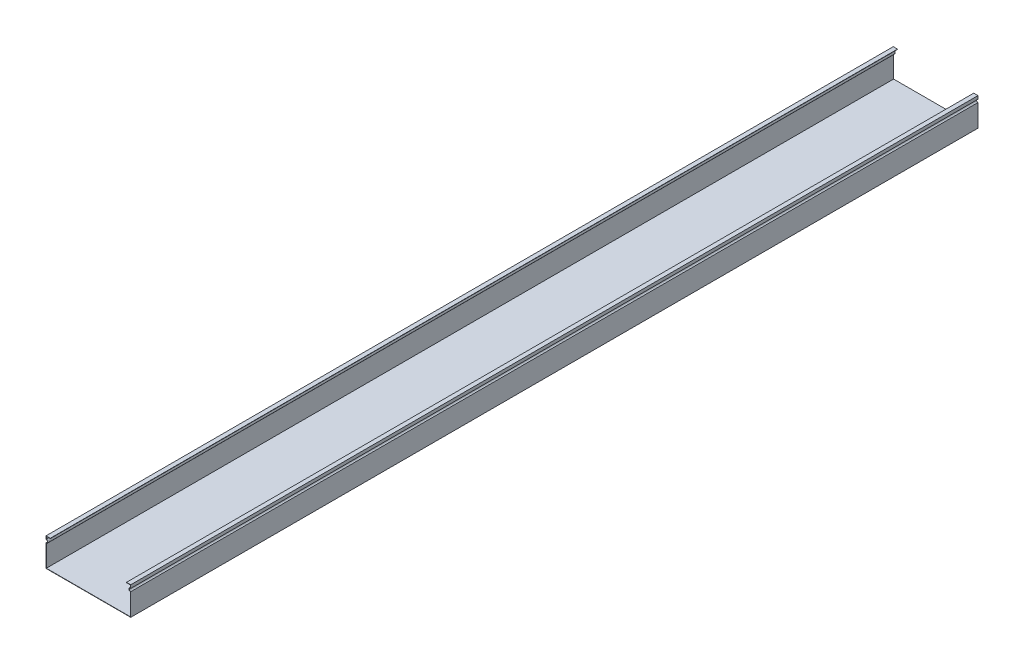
ISO-10303-21;
HEADER;
FILE_DESCRIPTION(('STEP AP214'),'2;1');
FILE_NAME('part.step','',(''),(''),'','','');
FILE_SCHEMA(('AUTOMOTIVE_DESIGN { 1 0 10303 214 1 1 1 1 }'));
ENDSEC;
DATA;
#1=APPLICATION_CONTEXT('core data for automotive mechanical design processes');
#2=APPLICATION_PROTOCOL_DEFINITION('international standard','automotive_design',2000,#1);
#3=PRODUCT_CONTEXT('',#1,'mechanical');
#4=PRODUCT('Part','Part','',(#3));
#5=PRODUCT_RELATED_PRODUCT_CATEGORY('part','',(#4));
#6=PRODUCT_DEFINITION_FORMATION('','',#4);
#7=PRODUCT_DEFINITION_CONTEXT('part definition',#1,'design');
#8=PRODUCT_DEFINITION('design','',#6,#7);
#9=PRODUCT_DEFINITION_SHAPE('','',#8);
#10=(LENGTH_UNIT() NAMED_UNIT(*) SI_UNIT(.MILLI.,.METRE.));
#11=(NAMED_UNIT(*) PLANE_ANGLE_UNIT() SI_UNIT($,.RADIAN.));
#12=(NAMED_UNIT(*) SI_UNIT($,.STERADIAN.) SOLID_ANGLE_UNIT());
#13=UNCERTAINTY_MEASURE_WITH_UNIT(LENGTH_MEASURE(1.E-05),#10,'distance_accuracy_value','');
#14=(GEOMETRIC_REPRESENTATION_CONTEXT(3) GLOBAL_UNCERTAINTY_ASSIGNED_CONTEXT((#13)) GLOBAL_UNIT_ASSIGNED_CONTEXT((#10,
#11,#12)) REPRESENTATION_CONTEXT('',''));
#15=CARTESIAN_POINT('',(0.,0.,0.));
#16=DIRECTION('',(0.,0.,1.));
#17=DIRECTION('',(1.,0.,0.));
#18=AXIS2_PLACEMENT_3D('',#15,#16,#17);
#19=CARTESIAN_POINT('',(0.,0.,3000.));
#20=DIRECTION('',(-1.,0.,0.));
#21=DIRECTION('',(0.,0.,1.));
#22=AXIS2_PLACEMENT_3D('',#19,#20,#21);
#23=PLANE('',#22);
#24=DIRECTION('',(0.,1.,0.));
#25=VECTOR('',#24,1.);
#26=CARTESIAN_POINT('',(0.,0.,0.));
#27=LINE('',#26,#25);
#28=CARTESIAN_POINT('',(0.,-1.21412,0.));
#29=VERTEX_POINT('',#28);
#30=CARTESIAN_POINT('',(0.,0.,0.));
#31=VERTEX_POINT('',#30);
#32=EDGE_CURVE('E199',#29,#31,#27,.T.);
#33=ORIENTED_EDGE('',*,*,#32,.T.);
#34=DIRECTION('',(0.,0.,-1.));
#35=VECTOR('',#34,1.);
#36=CARTESIAN_POINT('',(0.,0.,3000.));
#37=LINE('',#36,#35);
#38=CARTESIAN_POINT('',(0.,0.,3000.));
#39=VERTEX_POINT('',#38);
#40=EDGE_CURVE('E11',#39,#31,#37,.T.);
#41=ORIENTED_EDGE('',*,*,#40,.F.);
#42=DIRECTION('',(0.,1.,0.));
#43=VECTOR('',#42,1.);
#44=CARTESIAN_POINT('',(0.,0.,3000.));
#45=LINE('',#44,#43);
#46=CARTESIAN_POINT('',(0.,-1.21412,3000.));
#47=VERTEX_POINT('',#46);
#48=EDGE_CURVE('E237',#47,#39,#45,.T.);
#49=ORIENTED_EDGE('',*,*,#48,.F.);
#50=DIRECTION('',(0.,0.,-1.));
#51=VECTOR('',#50,1.);
#52=CARTESIAN_POINT('',(0.,-1.21412,3000.));
#53=LINE('',#52,#51);
#54=EDGE_CURVE('E195',#47,#29,#53,.T.);
#55=ORIENTED_EDGE('',*,*,#54,.T.);
#56=EDGE_LOOP('',(#33,#41,#49,#55));
#57=FACE_BOUND('',#56,.T.);
#58=ADVANCED_FACE('F31',(#57),#23,.F.);
#59=CARTESIAN_POINT('',(0.,0.,3000.));
#60=DIRECTION('',(0.,-1.,0.));
#61=DIRECTION('',(1.,0.,0.));
#62=AXIS2_PLACEMENT_3D('',#59,#60,#61);
#63=PLANE('',#62);
#64=DIRECTION('',(-1.,0.,0.));
#65=VECTOR('',#64,1.);
#66=CARTESIAN_POINT('',(0.,0.,0.));
#67=LINE('',#66,#65);
#68=CARTESIAN_POINT('',(-15.,0.,0.));
#69=VERTEX_POINT('',#68);
#70=EDGE_CURVE('E202',#31,#69,#67,.T.);
#71=ORIENTED_EDGE('',*,*,#70,.T.);
#72=DIRECTION('',(0.,0.,-1.));
#73=VECTOR('',#72,1.);
#74=CARTESIAN_POINT('',(-15.,0.,3000.));
#75=LINE('',#74,#73);
#76=CARTESIAN_POINT('',(-15.,0.,3000.));
#77=VERTEX_POINT('',#76);
#78=EDGE_CURVE('E39',#77,#69,#75,.T.);
#79=ORIENTED_EDGE('',*,*,#78,.F.);
#80=DIRECTION('',(-1.,0.,0.));
#81=VECTOR('',#80,1.);
#82=CARTESIAN_POINT('',(0.,0.,3000.));
#83=LINE('',#82,#81);
#84=EDGE_CURVE('E126',#39,#77,#83,.T.);
#85=ORIENTED_EDGE('',*,*,#84,.F.);
#86=ORIENTED_EDGE('',*,*,#40,.T.);
#87=EDGE_LOOP('',(#71,#79,#85,#86));
#88=FACE_BOUND('',#87,.T.);
#89=ADVANCED_FACE('F355',(#88),#63,.F.);
#90=CARTESIAN_POINT('',(-15.,0.,3000.));
#91=DIRECTION('',(1.,0.,0.));
#92=DIRECTION('',(0.,1.,0.));
#93=AXIS2_PLACEMENT_3D('',#90,#91,#92);
#94=PLANE('',#93);
#95=DIRECTION('',(0.,-1.,0.));
#96=VECTOR('',#95,1.);
#97=CARTESIAN_POINT('',(-15.,0.,0.));
#98=LINE('',#97,#96);
#99=CARTESIAN_POINT('',(-15.,-11.21412,0.));
#100=VERTEX_POINT('',#99);
#101=EDGE_CURVE('E204',#69,#100,#98,.T.);
#102=ORIENTED_EDGE('',*,*,#101,.T.);
#103=DIRECTION('',(0.,0.,-1.));
#104=VECTOR('',#103,1.);
#105=CARTESIAN_POINT('',(-15.,-11.21412,3000.));
#106=LINE('',#105,#104);
#107=CARTESIAN_POINT('',(-15.,-11.21412,3000.));
#108=VERTEX_POINT('',#107);
#109=EDGE_CURVE('E280',#108,#100,#106,.T.);
#110=ORIENTED_EDGE('',*,*,#109,.F.);
#111=DIRECTION('',(0.,-1.,0.));
#112=VECTOR('',#111,1.);
#113=CARTESIAN_POINT('',(-15.,0.,3000.));
#114=LINE('',#113,#112);
#115=EDGE_CURVE('E288',#77,#108,#114,.T.);
#116=ORIENTED_EDGE('',*,*,#115,.F.);
#117=ORIENTED_EDGE('',*,*,#78,.T.);
#118=EDGE_LOOP('',(#102,#110,#116,#117));
#119=FACE_BOUND('',#118,.T.);
#120=ADVANCED_FACE('F286',(#119),#94,.F.);
#121=CARTESIAN_POINT('',(-15.,-16.21412,3000.));
#122=DIRECTION('',(0.,0.,-1.));
#123=DIRECTION('',(-1.,0.,0.));
#124=AXIS2_PLACEMENT_3D('',#121,#122,#123);
#125=CYLINDRICAL_SURFACE('',#124,5.);
#126=CARTESIAN_POINT('',(-15.,-16.21412,0.));
#127=DIRECTION('',(0.,0.,-1.));
#128=DIRECTION('',(-1.,0.,0.));
#129=AXIS2_PLACEMENT_3D('',#126,#127,#128);
#130=CIRCLE('',#129,5.);
#131=CARTESIAN_POINT('',(-15.,-21.21412,0.));
#132=VERTEX_POINT('',#131);
#133=EDGE_CURVE('E206',#100,#132,#130,.T.);
#134=ORIENTED_EDGE('',*,*,#133,.T.);
#135=DIRECTION('',(0.,0.,-1.));
#136=VECTOR('',#135,1.);
#137=CARTESIAN_POINT('',(-15.,-21.21412,3000.));
#138=LINE('',#137,#136);
#139=CARTESIAN_POINT('',(-15.,-21.21412,3000.));
#140=VERTEX_POINT('',#139);
#141=EDGE_CURVE('E277',#140,#132,#138,.T.);
#142=ORIENTED_EDGE('',*,*,#141,.F.);
#143=CARTESIAN_POINT('',(-15.,-16.21412,3000.));
#144=DIRECTION('',(0.,0.,-1.));
#145=DIRECTION('',(-1.,0.,0.));
#146=AXIS2_PLACEMENT_3D('',#143,#144,#145);
#147=CIRCLE('',#146,5.);
#148=EDGE_CURVE('E306',#108,#140,#147,.T.);
#149=ORIENTED_EDGE('',*,*,#148,.F.);
#150=ORIENTED_EDGE('',*,*,#109,.T.);
#151=EDGE_LOOP('',(#134,#142,#149,#150));
#152=FACE_BOUND('',#151,.T.);
#153=ADVANCED_FACE('F297',(#152),#125,.F.);
#154=CARTESIAN_POINT('',(-15.,-21.21412,3000.));
#155=DIRECTION('',(1.,0.,0.));
#156=DIRECTION('',(0.,1.,0.));
#157=AXIS2_PLACEMENT_3D('',#154,#155,#156);
#158=PLANE('',#157);
#159=DIRECTION('',(0.,-1.,0.));
#160=VECTOR('',#159,1.);
#161=CARTESIAN_POINT('',(-15.,-21.21412,0.));
#162=LINE('',#161,#160);
#163=CARTESIAN_POINT('',(-15.,-100.,0.));
#164=VERTEX_POINT('',#163);
#165=EDGE_CURVE('E208',#132,#164,#162,.T.);
#166=ORIENTED_EDGE('',*,*,#165,.T.);
#167=DIRECTION('',(0.,0.,-1.));
#168=VECTOR('',#167,1.);
#169=CARTESIAN_POINT('',(-15.,-100.,3000.));
#170=LINE('',#169,#168);
#171=CARTESIAN_POINT('',(-15.,-100.,3000.));
#172=VERTEX_POINT('',#171);
#173=EDGE_CURVE('E274',#172,#164,#170,.T.);
#174=ORIENTED_EDGE('',*,*,#173,.F.);
#175=DIRECTION('',(0.,-1.,0.));
#176=VECTOR('',#175,1.);
#177=CARTESIAN_POINT('',(-15.,-21.21412,3000.));
#178=LINE('',#177,#176);
#179=EDGE_CURVE('E303',#140,#172,#178,.T.);
#180=ORIENTED_EDGE('',*,*,#179,.F.);
#181=ORIENTED_EDGE('',*,*,#141,.T.);
#182=EDGE_LOOP('',(#166,#174,#180,#181));
#183=FACE_BOUND('',#182,.T.);
#184=ADVANCED_FACE('F301',(#183),#158,.F.);
#185=CARTESIAN_POINT('',(-15.,-100.,3000.));
#186=DIRECTION('',(0.,1.,0.));
#187=DIRECTION('',(0.,0.,1.));
#188=AXIS2_PLACEMENT_3D('',#185,#186,#187);
#189=PLANE('',#188);
#190=DIRECTION('',(1.,0.,0.));
#191=VECTOR('',#190,1.);
#192=CARTESIAN_POINT('',(-15.,-100.,0.));
#193=LINE('',#192,#191);
#194=CARTESIAN_POINT('',(285.,-100.,0.));
#195=VERTEX_POINT('',#194);
#196=EDGE_CURVE('E210',#164,#195,#193,.T.);
#197=ORIENTED_EDGE('',*,*,#196,.T.);
#198=DIRECTION('',(0.,0.,-1.));
#199=VECTOR('',#198,1.);
#200=CARTESIAN_POINT('',(285.,-100.,3000.));
#201=LINE('',#200,#199);
#202=CARTESIAN_POINT('',(285.,-100.,3000.));
#203=VERTEX_POINT('',#202);
#204=EDGE_CURVE('E271',#203,#195,#201,.T.);
#205=ORIENTED_EDGE('',*,*,#204,.F.);
#206=DIRECTION('',(1.,0.,0.));
#207=VECTOR('',#206,1.);
#208=CARTESIAN_POINT('',(-15.,-100.,3000.));
#209=LINE('',#208,#207);
#210=EDGE_CURVE('E305',#172,#203,#209,.T.);
#211=ORIENTED_EDGE('',*,*,#210,.F.);
#212=ORIENTED_EDGE('',*,*,#173,.T.);
#213=EDGE_LOOP('',(#197,#205,#211,#212));
#214=FACE_BOUND('',#213,.T.);
#215=ADVANCED_FACE('F368',(#214),#189,.F.);
#216=CARTESIAN_POINT('',(285.,-100.,3000.));
#217=DIRECTION('',(-1.,0.,0.));
#218=DIRECTION('',(0.,-1.,0.));
#219=AXIS2_PLACEMENT_3D('',#216,#217,#218);
#220=PLANE('',#219);
#221=DIRECTION('',(0.,1.,0.));
#222=VECTOR('',#221,1.);
#223=CARTESIAN_POINT('',(285.,-100.,0.));
#224=LINE('',#223,#222);
#225=CARTESIAN_POINT('',(285.,-21.21412,0.));
#226=VERTEX_POINT('',#225);
#227=EDGE_CURVE('E212',#195,#226,#224,.T.);
#228=ORIENTED_EDGE('',*,*,#227,.T.);
#229=DIRECTION('',(0.,0.,-1.));
#230=VECTOR('',#229,1.);
#231=CARTESIAN_POINT('',(285.,-21.21412,3000.));
#232=LINE('',#231,#230);
#233=CARTESIAN_POINT('',(285.,-21.21412,3000.));
#234=VERTEX_POINT('',#233);
#235=EDGE_CURVE('E268',#234,#226,#232,.T.);
#236=ORIENTED_EDGE('',*,*,#235,.F.);
#237=DIRECTION('',(0.,1.,0.));
#238=VECTOR('',#237,1.);
#239=CARTESIAN_POINT('',(285.,-100.,3000.));
#240=LINE('',#239,#238);
#241=EDGE_CURVE('E308',#203,#234,#240,.T.);
#242=ORIENTED_EDGE('',*,*,#241,.F.);
#243=ORIENTED_EDGE('',*,*,#204,.T.);
#244=EDGE_LOOP('',(#228,#236,#242,#243));
#245=FACE_BOUND('',#244,.T.);
#246=ADVANCED_FACE('F371',(#245),#220,.F.);
#247=CARTESIAN_POINT('',(285.,-16.21412,3000.));
#248=DIRECTION('',(0.,0.,-1.));
#249=DIRECTION('',(-1.,0.,0.));
#250=AXIS2_PLACEMENT_3D('',#247,#248,#249);
#251=CYLINDRICAL_SURFACE('',#250,5.);
#252=CARTESIAN_POINT('',(285.,-16.21412,0.));
#253=DIRECTION('',(0.,0.,-1.));
#254=DIRECTION('',(1.,0.,0.));
#255=AXIS2_PLACEMENT_3D('',#252,#253,#254);
#256=CIRCLE('',#255,5.);
#257=CARTESIAN_POINT('',(285.,-11.21412,0.));
#258=VERTEX_POINT('',#257);
#259=EDGE_CURVE('E214',#226,#258,#256,.T.);
#260=ORIENTED_EDGE('',*,*,#259,.T.);
#261=DIRECTION('',(0.,0.,-1.));
#262=VECTOR('',#261,1.);
#263=CARTESIAN_POINT('',(285.,-11.21412,3000.));
#264=LINE('',#263,#262);
#265=CARTESIAN_POINT('',(285.,-11.21412,3000.));
#266=VERTEX_POINT('',#265);
#267=EDGE_CURVE('E265',#266,#258,#264,.T.);
#268=ORIENTED_EDGE('',*,*,#267,.F.);
#269=CARTESIAN_POINT('',(285.,-16.21412,3000.));
#270=DIRECTION('',(0.,0.,-1.));
#271=DIRECTION('',(1.,0.,0.));
#272=AXIS2_PLACEMENT_3D('',#269,#270,#271);
#273=CIRCLE('',#272,5.);
#274=EDGE_CURVE('E314',#234,#266,#273,.T.);
#275=ORIENTED_EDGE('',*,*,#274,.F.);
#276=ORIENTED_EDGE('',*,*,#235,.T.);
#277=EDGE_LOOP('',(#260,#268,#275,#276));
#278=FACE_BOUND('',#277,.T.);
#279=ADVANCED_FACE('F375',(#278),#251,.F.);
#280=CARTESIAN_POINT('',(285.,-11.21412,3000.));
#281=DIRECTION('',(-1.,0.,0.));
#282=DIRECTION('',(0.,-1.,0.));
#283=AXIS2_PLACEMENT_3D('',#280,#281,#282);
#284=PLANE('',#283);
#285=DIRECTION('',(0.,1.,0.));
#286=VECTOR('',#285,1.);
#287=CARTESIAN_POINT('',(285.,-11.21412,0.));
#288=LINE('',#287,#286);
#289=CARTESIAN_POINT('',(285.,0.,0.));
#290=VERTEX_POINT('',#289);
#291=EDGE_CURVE('E216',#258,#290,#288,.T.);
#292=ORIENTED_EDGE('',*,*,#291,.T.);
#293=DIRECTION('',(0.,0.,-1.));
#294=VECTOR('',#293,1.);
#295=CARTESIAN_POINT('',(285.,0.,3000.));
#296=LINE('',#295,#294);
#297=CARTESIAN_POINT('',(285.,0.,3000.));
#298=VERTEX_POINT('',#297);
#299=EDGE_CURVE('E262',#298,#290,#296,.T.);
#300=ORIENTED_EDGE('',*,*,#299,.F.);
#301=DIRECTION('',(0.,1.,0.));
#302=VECTOR('',#301,1.);
#303=CARTESIAN_POINT('',(285.,-11.21412,3000.));
#304=LINE('',#303,#302);
#305=EDGE_CURVE('E316',#266,#298,#304,.T.);
#306=ORIENTED_EDGE('',*,*,#305,.F.);
#307=ORIENTED_EDGE('',*,*,#267,.T.);
#308=EDGE_LOOP('',(#292,#300,#306,#307));
#309=FACE_BOUND('',#308,.T.);
#310=ADVANCED_FACE('F379',(#309),#284,.F.);
#311=CARTESIAN_POINT('',(285.,0.,3000.));
#312=DIRECTION('',(0.,-1.,0.));
#313=DIRECTION('',(1.,0.,0.));
#314=AXIS2_PLACEMENT_3D('',#311,#312,#313);
#315=PLANE('',#314);
#316=DIRECTION('',(-1.,0.,0.));
#317=VECTOR('',#316,1.);
#318=CARTESIAN_POINT('',(285.,0.,0.));
#319=LINE('',#318,#317);
#320=CARTESIAN_POINT('',(270.,0.,0.));
#321=VERTEX_POINT('',#320);
#322=EDGE_CURVE('E218',#290,#321,#319,.T.);
#323=ORIENTED_EDGE('',*,*,#322,.T.);
#324=DIRECTION('',(0.,0.,-1.));
#325=VECTOR('',#324,1.);
#326=CARTESIAN_POINT('',(270.,0.,3000.));
#327=LINE('',#326,#325);
#328=CARTESIAN_POINT('',(270.,0.,3000.));
#329=VERTEX_POINT('',#328);
#330=EDGE_CURVE('E259',#329,#321,#327,.T.);
#331=ORIENTED_EDGE('',*,*,#330,.F.);
#332=DIRECTION('',(-1.,0.,0.));
#333=VECTOR('',#332,1.);
#334=CARTESIAN_POINT('',(285.,0.,3000.));
#335=LINE('',#334,#333);
#336=EDGE_CURVE('E318',#298,#329,#335,.T.);
#337=ORIENTED_EDGE('',*,*,#336,.F.);
#338=ORIENTED_EDGE('',*,*,#299,.T.);
#339=EDGE_LOOP('',(#323,#331,#337,#338));
#340=FACE_BOUND('',#339,.T.);
#341=ADVANCED_FACE('F383',(#340),#315,.F.);
#342=CARTESIAN_POINT('',(270.,0.,3000.));
#343=DIRECTION('',(1.,0.,0.));
#344=DIRECTION('',(0.,0.,-1.));
#345=AXIS2_PLACEMENT_3D('',#342,#343,#344);
#346=PLANE('',#345);
#347=DIRECTION('',(0.,-1.,0.));
#348=VECTOR('',#347,1.);
#349=CARTESIAN_POINT('',(270.,0.,0.));
#350=LINE('',#349,#348);
#351=CARTESIAN_POINT('',(270.,-1.21412,0.));
#352=VERTEX_POINT('',#351);
#353=EDGE_CURVE('E220',#321,#352,#350,.T.);
#354=ORIENTED_EDGE('',*,*,#353,.T.);
#355=DIRECTION('',(0.,0.,-1.));
#356=VECTOR('',#355,1.);
#357=CARTESIAN_POINT('',(270.,-1.21412,3000.));
#358=LINE('',#357,#356);
#359=CARTESIAN_POINT('',(270.,-1.21412,3000.));
#360=VERTEX_POINT('',#359);
#361=EDGE_CURVE('E256',#360,#352,#358,.T.);
#362=ORIENTED_EDGE('',*,*,#361,.F.);
#363=DIRECTION('',(0.,-1.,0.));
#364=VECTOR('',#363,1.);
#365=CARTESIAN_POINT('',(270.,0.,3000.));
#366=LINE('',#365,#364);
#367=EDGE_CURVE('E320',#329,#360,#366,.T.);
#368=ORIENTED_EDGE('',*,*,#367,.F.);
#369=ORIENTED_EDGE('',*,*,#330,.T.);
#370=EDGE_LOOP('',(#354,#362,#368,#369));
#371=FACE_BOUND('',#370,.T.);
#372=ADVANCED_FACE('F387',(#371),#346,.F.);
#373=CARTESIAN_POINT('',(283.78588,-1.21412,3000.));
#374=DIRECTION('',(0.,1.,0.));
#375=DIRECTION('',(-1.,0.,0.));
#376=AXIS2_PLACEMENT_3D('',#373,#374,#375);
#377=PLANE('',#376);
#378=DIRECTION('',(1.,0.,0.));
#379=VECTOR('',#378,1.);
#380=CARTESIAN_POINT('',(283.78588,-1.21412,0.));
#381=LINE('',#380,#379);
#382=CARTESIAN_POINT('',(283.78588,-1.21412,0.));
#383=VERTEX_POINT('',#382);
#384=EDGE_CURVE('E222',#352,#383,#381,.T.);
#385=ORIENTED_EDGE('',*,*,#384,.T.);
#386=DIRECTION('',(0.,0.,-1.));
#387=VECTOR('',#386,1.);
#388=CARTESIAN_POINT('',(283.78588,-1.21412,3000.));
#389=LINE('',#388,#387);
#390=CARTESIAN_POINT('',(283.78588,-1.21412,3000.));
#391=VERTEX_POINT('',#390);
#392=EDGE_CURVE('E253',#391,#383,#389,.T.);
#393=ORIENTED_EDGE('',*,*,#392,.F.);
#394=DIRECTION('',(1.,0.,0.));
#395=VECTOR('',#394,1.);
#396=CARTESIAN_POINT('',(283.78588,-1.21412,3000.));
#397=LINE('',#396,#395);
#398=EDGE_CURVE('E322',#360,#391,#397,.T.);
#399=ORIENTED_EDGE('',*,*,#398,.F.);
#400=ORIENTED_EDGE('',*,*,#361,.T.);
#401=EDGE_LOOP('',(#385,#393,#399,#400));
#402=FACE_BOUND('',#401,.T.);
#403=ADVANCED_FACE('F391',(#402),#377,.F.);
#404=CARTESIAN_POINT('',(283.78588,-10.119761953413,3000.));
#405=DIRECTION('',(1.,0.,0.));
#406=DIRECTION('',(0.,1.,0.));
#407=AXIS2_PLACEMENT_3D('',#404,#405,#406);
#408=PLANE('',#407);
#409=DIRECTION('',(0.,-1.,0.));
#410=VECTOR('',#409,1.);
#411=CARTESIAN_POINT('',(283.78588,-10.119761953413,0.));
#412=LINE('',#411,#410);
#413=CARTESIAN_POINT('',(283.78588,-10.119761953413,0.));
#414=VERTEX_POINT('',#413);
#415=EDGE_CURVE('E224',#383,#414,#412,.T.);
#416=ORIENTED_EDGE('',*,*,#415,.T.);
#417=DIRECTION('',(0.,0.,-1.));
#418=VECTOR('',#417,1.);
#419=CARTESIAN_POINT('',(283.78588,-10.119761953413,3000.));
#420=LINE('',#419,#418);
#421=CARTESIAN_POINT('',(283.78588,-10.119761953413,3000.));
#422=VERTEX_POINT('',#421);
#423=EDGE_CURVE('E250',#422,#414,#420,.T.);
#424=ORIENTED_EDGE('',*,*,#423,.F.);
#425=DIRECTION('',(0.,-1.,0.));
#426=VECTOR('',#425,1.);
#427=CARTESIAN_POINT('',(283.78588,-10.119761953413,3000.));
#428=LINE('',#427,#426);
#429=EDGE_CURVE('E324',#391,#422,#428,.T.);
#430=ORIENTED_EDGE('',*,*,#429,.F.);
#431=ORIENTED_EDGE('',*,*,#392,.T.);
#432=EDGE_LOOP('',(#416,#424,#430,#431));
#433=FACE_BOUND('',#432,.T.);
#434=ADVANCED_FACE('F395',(#433),#408,.F.);
#435=CARTESIAN_POINT('',(285.,-16.21412,3000.));
#436=DIRECTION('',(0.,0.,-1.));
#437=DIRECTION('',(-1.,0.,0.));
#438=AXIS2_PLACEMENT_3D('',#435,#436,#437);
#439=CYLINDRICAL_SURFACE('',#438,6.21412);
#440=CARTESIAN_POINT('',(285.,-16.21412,0.));
#441=DIRECTION('',(0.,0.,1.));
#442=DIRECTION('',(1.,0.,0.));
#443=AXIS2_PLACEMENT_3D('',#440,#441,#442);
#444=CIRCLE('',#443,6.21412);
#445=CARTESIAN_POINT('',(283.78588,-22.308478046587,0.));
#446=VERTEX_POINT('',#445);
#447=EDGE_CURVE('E226',#414,#446,#444,.T.);
#448=ORIENTED_EDGE('',*,*,#447,.T.);
#449=DIRECTION('',(0.,0.,-1.));
#450=VECTOR('',#449,1.);
#451=CARTESIAN_POINT('',(283.78588,-22.308478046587,3000.));
#452=LINE('',#451,#450);
#453=CARTESIAN_POINT('',(283.78588,-22.308478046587,3000.));
#454=VERTEX_POINT('',#453);
#455=EDGE_CURVE('E247',#454,#446,#452,.T.);
#456=ORIENTED_EDGE('',*,*,#455,.F.);
#457=CARTESIAN_POINT('',(285.,-16.21412,3000.));
#458=DIRECTION('',(0.,0.,1.));
#459=DIRECTION('',(1.,0.,0.));
#460=AXIS2_PLACEMENT_3D('',#457,#458,#459);
#461=CIRCLE('',#460,6.21412);
#462=EDGE_CURVE('E326',#422,#454,#461,.T.);
#463=ORIENTED_EDGE('',*,*,#462,.F.);
#464=ORIENTED_EDGE('',*,*,#423,.T.);
#465=EDGE_LOOP('',(#448,#456,#463,#464));
#466=FACE_BOUND('',#465,.T.);
#467=ADVANCED_FACE('F399',(#466),#439,.T.);
#468=CARTESIAN_POINT('',(283.78588,-98.78588,3000.));
#469=DIRECTION('',(1.,0.,0.));
#470=DIRECTION('',(0.,1.,0.));
#471=AXIS2_PLACEMENT_3D('',#468,#469,#470);
#472=PLANE('',#471);
#473=DIRECTION('',(0.,-1.,0.));
#474=VECTOR('',#473,1.);
#475=CARTESIAN_POINT('',(283.78588,-98.78588,0.));
#476=LINE('',#475,#474);
#477=CARTESIAN_POINT('',(283.78588,-98.78588,0.));
#478=VERTEX_POINT('',#477);
#479=EDGE_CURVE('E228',#446,#478,#476,.T.);
#480=ORIENTED_EDGE('',*,*,#479,.T.);
#481=DIRECTION('',(0.,0.,-1.));
#482=VECTOR('',#481,1.);
#483=CARTESIAN_POINT('',(283.78588,-98.78588,3000.));
#484=LINE('',#483,#482);
#485=CARTESIAN_POINT('',(283.78588,-98.78588,3000.));
#486=VERTEX_POINT('',#485);
#487=EDGE_CURVE('E244',#486,#478,#484,.T.);
#488=ORIENTED_EDGE('',*,*,#487,.F.);
#489=DIRECTION('',(0.,-1.,0.));
#490=VECTOR('',#489,1.);
#491=CARTESIAN_POINT('',(283.78588,-98.78588,3000.));
#492=LINE('',#491,#490);
#493=EDGE_CURVE('E328',#454,#486,#492,.T.);
#494=ORIENTED_EDGE('',*,*,#493,.F.);
#495=ORIENTED_EDGE('',*,*,#455,.T.);
#496=EDGE_LOOP('',(#480,#488,#494,#495));
#497=FACE_BOUND('',#496,.T.);
#498=ADVANCED_FACE('F403',(#497),#472,.F.);
#499=CARTESIAN_POINT('',(-13.78588,-98.78588,3000.));
#500=DIRECTION('',(0.,-1.,0.));
#501=DIRECTION('',(0.,0.,-1.));
#502=AXIS2_PLACEMENT_3D('',#499,#500,#501);
#503=PLANE('',#502);
#504=DIRECTION('',(-1.,0.,0.));
#505=VECTOR('',#504,1.);
#506=CARTESIAN_POINT('',(-13.78588,-98.78588,0.));
#507=LINE('',#506,#505);
#508=CARTESIAN_POINT('',(-13.78588,-98.78588,0.));
#509=VERTEX_POINT('',#508);
#510=EDGE_CURVE('E230',#478,#509,#507,.T.);
#511=ORIENTED_EDGE('',*,*,#510,.T.);
#512=DIRECTION('',(0.,0.,-1.));
#513=VECTOR('',#512,1.);
#514=CARTESIAN_POINT('',(-13.78588,-98.78588,3000.));
#515=LINE('',#514,#513);
#516=CARTESIAN_POINT('',(-13.78588,-98.78588,3000.));
#517=VERTEX_POINT('',#516);
#518=EDGE_CURVE('E241',#517,#509,#515,.T.);
#519=ORIENTED_EDGE('',*,*,#518,.F.);
#520=DIRECTION('',(-1.,0.,0.));
#521=VECTOR('',#520,1.);
#522=CARTESIAN_POINT('',(-13.78588,-98.78588,3000.));
#523=LINE('',#522,#521);
#524=EDGE_CURVE('E330',#486,#517,#523,.T.);
#525=ORIENTED_EDGE('',*,*,#524,.F.);
#526=ORIENTED_EDGE('',*,*,#487,.T.);
#527=EDGE_LOOP('',(#511,#519,#525,#526));
#528=FACE_BOUND('',#527,.T.);
#529=ADVANCED_FACE('F336',(#528),#503,.F.);
#530=CARTESIAN_POINT('',(-13.78588,-22.308478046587,3000.));
#531=DIRECTION('',(-1.,0.,0.));
#532=DIRECTION('',(0.,-1.,0.));
#533=AXIS2_PLACEMENT_3D('',#530,#531,#532);
#534=PLANE('',#533);
#535=DIRECTION('',(0.,1.,0.));
#536=VECTOR('',#535,1.);
#537=CARTESIAN_POINT('',(-13.78588,-22.308478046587,0.));
#538=LINE('',#537,#536);
#539=CARTESIAN_POINT('',(-13.78588,-22.308478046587,0.));
#540=VERTEX_POINT('',#539);
#541=EDGE_CURVE('E232',#509,#540,#538,.T.);
#542=ORIENTED_EDGE('',*,*,#541,.T.);
#543=DIRECTION('',(0.,0.,-1.));
#544=VECTOR('',#543,1.);
#545=CARTESIAN_POINT('',(-13.78588,-22.308478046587,3000.));
#546=LINE('',#545,#544);
#547=CARTESIAN_POINT('',(-13.78588,-22.308478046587,3000.));
#548=VERTEX_POINT('',#547);
#549=EDGE_CURVE('E190',#548,#540,#546,.T.);
#550=ORIENTED_EDGE('',*,*,#549,.F.);
#551=DIRECTION('',(0.,1.,0.));
#552=VECTOR('',#551,1.);
#553=CARTESIAN_POINT('',(-13.78588,-22.308478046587,3000.));
#554=LINE('',#553,#552);
#555=EDGE_CURVE('E181',#517,#548,#554,.T.);
#556=ORIENTED_EDGE('',*,*,#555,.F.);
#557=ORIENTED_EDGE('',*,*,#518,.T.);
#558=EDGE_LOOP('',(#542,#550,#556,#557));
#559=FACE_BOUND('',#558,.T.);
#560=ADVANCED_FACE('F340',(#559),#534,.F.);
#561=CARTESIAN_POINT('',(-15.,-16.21412,3000.));
#562=DIRECTION('',(0.,0.,-1.));
#563=DIRECTION('',(-1.,0.,0.));
#564=AXIS2_PLACEMENT_3D('',#561,#562,#563);
#565=CYLINDRICAL_SURFACE('',#564,6.21412);
#566=CARTESIAN_POINT('',(-15.,-16.21412,0.));
#567=DIRECTION('',(0.,0.,1.));
#568=DIRECTION('',(-1.,0.,0.));
#569=AXIS2_PLACEMENT_3D('',#566,#567,#568);
#570=CIRCLE('',#569,6.21412);
#571=CARTESIAN_POINT('',(-13.78588,-10.119761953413,0.));
#572=VERTEX_POINT('',#571);
#573=EDGE_CURVE('E189',#540,#572,#570,.T.);
#574=ORIENTED_EDGE('',*,*,#573,.T.);
#575=DIRECTION('',(0.,0.,-1.));
#576=VECTOR('',#575,1.);
#577=CARTESIAN_POINT('',(-13.78588,-10.119761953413,3000.));
#578=LINE('',#577,#576);
#579=CARTESIAN_POINT('',(-13.78588,-10.119761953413,3000.));
#580=VERTEX_POINT('',#579);
#581=EDGE_CURVE('E186',#580,#572,#578,.T.);
#582=ORIENTED_EDGE('',*,*,#581,.F.);
#583=CARTESIAN_POINT('',(-15.,-16.21412,3000.));
#584=DIRECTION('',(0.,0.,1.));
#585=DIRECTION('',(-1.,0.,0.));
#586=AXIS2_PLACEMENT_3D('',#583,#584,#585);
#587=CIRCLE('',#586,6.21412);
#588=EDGE_CURVE('E175',#548,#580,#587,.T.);
#589=ORIENTED_EDGE('',*,*,#588,.F.);
#590=ORIENTED_EDGE('',*,*,#549,.T.);
#591=EDGE_LOOP('',(#574,#582,#589,#590));
#592=FACE_BOUND('',#591,.T.);
#593=ADVANCED_FACE('F187',(#592),#565,.T.);
#594=CARTESIAN_POINT('',(-13.78588,-1.21412,3000.));
#595=DIRECTION('',(-1.,0.,0.));
#596=DIRECTION('',(0.,-1.,0.));
#597=AXIS2_PLACEMENT_3D('',#594,#595,#596);
#598=PLANE('',#597);
#599=DIRECTION('',(0.,1.,0.));
#600=VECTOR('',#599,1.);
#601=CARTESIAN_POINT('',(-13.78588,-1.21412,0.));
#602=LINE('',#601,#600);
#603=CARTESIAN_POINT('',(-13.78588,-1.21412,0.));
#604=VERTEX_POINT('',#603);
#605=EDGE_CURVE('E112',#572,#604,#602,.T.);
#606=ORIENTED_EDGE('',*,*,#605,.T.);
#607=DIRECTION('',(0.,0.,-1.));
#608=VECTOR('',#607,1.);
#609=CARTESIAN_POINT('',(-13.78588,-1.21412,3000.));
#610=LINE('',#609,#608);
#611=CARTESIAN_POINT('',(-13.78588,-1.21412,3000.));
#612=VERTEX_POINT('',#611);
#613=EDGE_CURVE('E191',#612,#604,#610,.T.);
#614=ORIENTED_EDGE('',*,*,#613,.F.);
#615=DIRECTION('',(0.,1.,0.));
#616=VECTOR('',#615,1.);
#617=CARTESIAN_POINT('',(-13.78588,-1.21412,3000.));
#618=LINE('',#617,#616);
#619=EDGE_CURVE('E179',#580,#612,#618,.T.);
#620=ORIENTED_EDGE('',*,*,#619,.F.);
#621=ORIENTED_EDGE('',*,*,#581,.T.);
#622=EDGE_LOOP('',(#606,#614,#620,#621));
#623=FACE_BOUND('',#622,.T.);
#624=ADVANCED_FACE('F193',(#623),#598,.F.);
#625=CARTESIAN_POINT('',(0.,-1.21412,3000.));
#626=DIRECTION('',(0.,1.,0.));
#627=DIRECTION('',(-1.,0.,0.));
#628=AXIS2_PLACEMENT_3D('',#625,#626,#627);
#629=PLANE('',#628);
#630=DIRECTION('',(1.,0.,0.));
#631=VECTOR('',#630,1.);
#632=CARTESIAN_POINT('',(0.,-1.21412,0.));
#633=LINE('',#632,#631);
#634=EDGE_CURVE('E118',#604,#29,#633,.T.);
#635=ORIENTED_EDGE('',*,*,#634,.T.);
#636=ORIENTED_EDGE('',*,*,#54,.F.);
#637=DIRECTION('',(1.,0.,0.));
#638=VECTOR('',#637,1.);
#639=CARTESIAN_POINT('',(0.,-1.21412,3000.));
#640=LINE('',#639,#638);
#641=EDGE_CURVE('E47',#612,#47,#640,.T.);
#642=ORIENTED_EDGE('',*,*,#641,.F.);
#643=ORIENTED_EDGE('',*,*,#613,.T.);
#644=EDGE_LOOP('',(#635,#636,#642,#643));
#645=FACE_BOUND('',#644,.T.);
#646=ADVANCED_FACE('F344',(#645),#629,.F.);
#647=CARTESIAN_POINT('',(-15.,-16.21412,3000.));
#648=DIRECTION('',(0.,0.,-1.));
#649=DIRECTION('',(-1.,0.,0.));
#650=AXIS2_PLACEMENT_3D('',#647,#648,#649);
#651=PLANE('',#650);
#652=ORIENTED_EDGE('',*,*,#48,.T.);
#653=ORIENTED_EDGE('',*,*,#84,.T.);
#654=ORIENTED_EDGE('',*,*,#115,.T.);
#655=ORIENTED_EDGE('',*,*,#148,.T.);
#656=ORIENTED_EDGE('',*,*,#179,.T.);
#657=ORIENTED_EDGE('',*,*,#210,.T.);
#658=ORIENTED_EDGE('',*,*,#241,.T.);
#659=ORIENTED_EDGE('',*,*,#274,.T.);
#660=ORIENTED_EDGE('',*,*,#305,.T.);
#661=ORIENTED_EDGE('',*,*,#336,.T.);
#662=ORIENTED_EDGE('',*,*,#367,.T.);
#663=ORIENTED_EDGE('',*,*,#398,.T.);
#664=ORIENTED_EDGE('',*,*,#429,.T.);
#665=ORIENTED_EDGE('',*,*,#462,.T.);
#666=ORIENTED_EDGE('',*,*,#493,.T.);
#667=ORIENTED_EDGE('',*,*,#524,.T.);
#668=ORIENTED_EDGE('',*,*,#555,.T.);
#669=ORIENTED_EDGE('',*,*,#588,.T.);
#670=ORIENTED_EDGE('',*,*,#619,.T.);
#671=ORIENTED_EDGE('',*,*,#641,.T.);
#672=EDGE_LOOP('',(#652,#653,#654,#655,#656,#657,#658,#659,#660,#661,#662,#663,#664,#665,#666,
#667,#668,#669,#670,#671));
#673=FACE_BOUND('',#672,.T.);
#674=ADVANCED_FACE('F177',(#673),#651,.F.);
#675=CARTESIAN_POINT('',(-15.,-16.21412,0.));
#676=DIRECTION('',(0.,0.,-1.));
#677=DIRECTION('',(-1.,0.,0.));
#678=AXIS2_PLACEMENT_3D('',#675,#676,#677);
#679=PLANE('',#678);
#680=ORIENTED_EDGE('',*,*,#32,.F.);
#681=ORIENTED_EDGE('',*,*,#634,.F.);
#682=ORIENTED_EDGE('',*,*,#605,.F.);
#683=ORIENTED_EDGE('',*,*,#573,.F.);
#684=ORIENTED_EDGE('',*,*,#541,.F.);
#685=ORIENTED_EDGE('',*,*,#510,.F.);
#686=ORIENTED_EDGE('',*,*,#479,.F.);
#687=ORIENTED_EDGE('',*,*,#447,.F.);
#688=ORIENTED_EDGE('',*,*,#415,.F.);
#689=ORIENTED_EDGE('',*,*,#384,.F.);
#690=ORIENTED_EDGE('',*,*,#353,.F.);
#691=ORIENTED_EDGE('',*,*,#322,.F.);
#692=ORIENTED_EDGE('',*,*,#291,.F.);
#693=ORIENTED_EDGE('',*,*,#259,.F.);
#694=ORIENTED_EDGE('',*,*,#227,.F.);
#695=ORIENTED_EDGE('',*,*,#196,.F.);
#696=ORIENTED_EDGE('',*,*,#165,.F.);
#697=ORIENTED_EDGE('',*,*,#133,.F.);
#698=ORIENTED_EDGE('',*,*,#101,.F.);
#699=ORIENTED_EDGE('',*,*,#70,.F.);
#700=EDGE_LOOP('',(#680,#681,#682,#683,#684,#685,#686,#687,#688,#689,#690,#691,#692,#693,#694,
#695,#696,#697,#698,#699));
#701=FACE_BOUND('',#700,.T.);
#702=ADVANCED_FACE('F292',(#701),#679,.T.);
#703=CLOSED_SHELL('',(#58,#89,#120,#153,#184,#215,#246,#279,#310,#341,#372,#403,#434,#467,#498,
#529,#560,#593,#624,#646,#674,#702));
#704=MANIFOLD_SOLID_BREP('B2',#703);
#705=ADVANCED_BREP_SHAPE_REPRESENTATION('',(#18,#704),#14);
#706=SHAPE_DEFINITION_REPRESENTATION(#9,#705);
ENDSEC;
END-ISO-10303-21;
